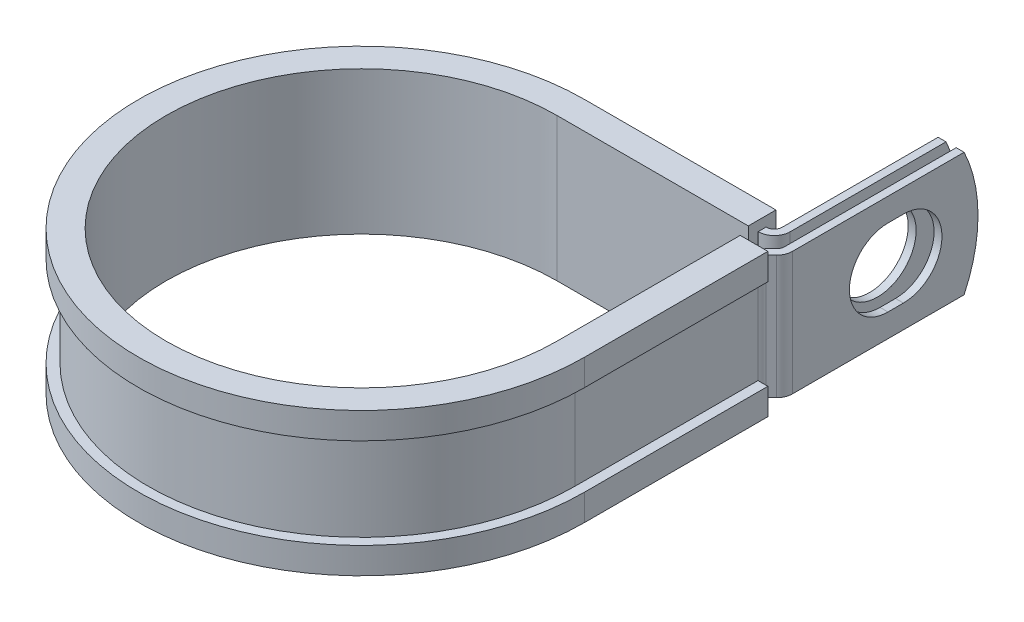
ISO-10303-21;
HEADER;
FILE_DESCRIPTION(('STEP AP214'),'2;1');
FILE_NAME('part.step','',(''),(''),'','','');
FILE_SCHEMA(('AUTOMOTIVE_DESIGN { 1 0 10303 214 1 1 1 1 }'));
ENDSEC;
DATA;
#1=APPLICATION_CONTEXT('core data for automotive mechanical design processes');
#2=APPLICATION_PROTOCOL_DEFINITION('international standard','automotive_design',2000,#1);
#3=PRODUCT_CONTEXT('',#1,'mechanical');
#4=PRODUCT('Part','Part','',(#3));
#5=PRODUCT_RELATED_PRODUCT_CATEGORY('part','',(#4));
#6=PRODUCT_DEFINITION_FORMATION('','',#4);
#7=PRODUCT_DEFINITION_CONTEXT('part definition',#1,'design');
#8=PRODUCT_DEFINITION('design','',#6,#7);
#9=PRODUCT_DEFINITION_SHAPE('','',#8);
#10=(LENGTH_UNIT() NAMED_UNIT(*) SI_UNIT(.MILLI.,.METRE.));
#11=(NAMED_UNIT(*) PLANE_ANGLE_UNIT() SI_UNIT($,.RADIAN.));
#12=(NAMED_UNIT(*) SI_UNIT($,.STERADIAN.) SOLID_ANGLE_UNIT());
#13=UNCERTAINTY_MEASURE_WITH_UNIT(LENGTH_MEASURE(1.E-05),#10,'distance_accuracy_value','');
#14=(GEOMETRIC_REPRESENTATION_CONTEXT(3) GLOBAL_UNCERTAINTY_ASSIGNED_CONTEXT((#13)) GLOBAL_UNIT_ASSIGNED_CONTEXT((#10,
#11,#12)) REPRESENTATION_CONTEXT('',''));
#15=CARTESIAN_POINT('',(0.,0.,0.));
#16=DIRECTION('',(0.,0.,1.));
#17=DIRECTION('',(1.,0.,0.));
#18=AXIS2_PLACEMENT_3D('',#15,#16,#17);
#19=CARTESIAN_POINT('',(32.3647698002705,-9.525,-31.6865));
#20=DIRECTION('',(0.,1.,0.));
#21=DIRECTION('',(1.,0.,0.));
#22=AXIS2_PLACEMENT_3D('',#19,#20,#21);
#23=PLANE('',#22);
#24=DIRECTION('',(0.,0.,-1.));
#25=VECTOR('',#24,1.);
#26=CARTESIAN_POINT('',(29.5199698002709,-9.525,-31.6865));
#27=LINE('',#26,#25);
#28=CARTESIAN_POINT('',(29.5199698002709,-9.525,-31.6865));
#29=VERTEX_POINT('',#28);
#30=CARTESIAN_POINT('',(29.5199698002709,-9.525,-32.9057));
#31=VERTEX_POINT('',#30);
#32=EDGE_CURVE('E523',#29,#31,#27,.T.);
#33=ORIENTED_EDGE('',*,*,#32,.T.);
#34=DIRECTION('',(1.,0.,0.));
#35=VECTOR('',#34,1.);
#36=CARTESIAN_POINT('',(0.,-9.525,-32.9057));
#37=LINE('',#36,#35);
#38=CARTESIAN_POINT('',(29.5707698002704,-9.525,-32.9057));
#39=VERTEX_POINT('',#38);
#40=EDGE_CURVE('E410',#39,#31,#37,.F.);
#41=ORIENTED_EDGE('',*,*,#40,.F.);
#42=CARTESIAN_POINT('',(29.5707698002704,-9.525,-34.1249));
#43=DIRECTION('',(0.,1.,0.));
#44=DIRECTION('',(1.,0.,0.));
#45=AXIS2_PLACEMENT_3D('',#42,#43,#44);
#46=CIRCLE('',#45,1.2192);
#47=CARTESIAN_POINT('',(30.7899698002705,-9.525,-34.1249));
#48=VERTEX_POINT('',#47);
#49=EDGE_CURVE('E408',#48,#39,#46,.F.);
#50=ORIENTED_EDGE('',*,*,#49,.F.);
#51=DIRECTION('',(0.,0.,1.));
#52=VECTOR('',#51,1.);
#53=CARTESIAN_POINT('',(30.7899698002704,-9.525,-60.325));
#54=LINE('',#53,#52);
#55=CARTESIAN_POINT('',(30.7899698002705,-9.525,-58.1804631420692));
#56=VERTEX_POINT('',#55);
#57=EDGE_CURVE('E406',#56,#48,#54,.T.);
#58=ORIENTED_EDGE('',*,*,#57,.F.);
#59=DIRECTION('',(-1.,0.,0.));
#60=VECTOR('',#59,1.);
#61=CARTESIAN_POINT('',(34.8031698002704,-9.525,-58.1804631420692));
#62=LINE('',#61,#60);
#63=CARTESIAN_POINT('',(32.0091698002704,-9.525,-58.1804631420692));
#64=VERTEX_POINT('',#63);
#65=EDGE_CURVE('E12',#64,#56,#62,.T.);
#66=ORIENTED_EDGE('',*,*,#65,.F.);
#67=DIRECTION('',(0.,0.,1.));
#68=VECTOR('',#67,1.);
#69=CARTESIAN_POINT('',(32.0091698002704,-9.525,-60.325));
#70=LINE('',#69,#68);
#71=CARTESIAN_POINT('',(32.0091698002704,-9.525,-34.1249));
#72=VERTEX_POINT('',#71);
#73=EDGE_CURVE('E404',#64,#72,#70,.T.);
#74=ORIENTED_EDGE('',*,*,#73,.T.);
#75=CARTESIAN_POINT('',(29.5707698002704,-9.525,-34.1249));
#76=DIRECTION('',(0.,-1.,0.));
#77=DIRECTION('',(0.,0.,1.));
#78=AXIS2_PLACEMENT_3D('',#75,#76,#77);
#79=CIRCLE('',#78,2.4384);
#80=CARTESIAN_POINT('',(29.5707698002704,-9.525,-31.6865));
#81=VERTEX_POINT('',#80);
#82=EDGE_CURVE('E401',#72,#81,#79,.T.);
#83=ORIENTED_EDGE('',*,*,#82,.T.);
#84=DIRECTION('',(-1.,0.,0.));
#85=VECTOR('',#84,1.);
#86=CARTESIAN_POINT('',(0.,-9.525,-31.6865));
#87=LINE('',#86,#85);
#88=EDGE_CURVE('E398',#81,#29,#87,.T.);
#89=ORIENTED_EDGE('',*,*,#88,.T.);
#90=EDGE_LOOP('',(#33,#41,#50,#58,#66,#74,#83,#89));
#91=FACE_BOUND('',#90,.T.);
#92=ADVANCED_FACE('F54',(#91),#23,.F.);
#93=CARTESIAN_POINT('',(32.3647698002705,9.525,-31.6865));
#94=DIRECTION('',(0.,1.,0.));
#95=DIRECTION('',(1.,0.,0.));
#96=AXIS2_PLACEMENT_3D('',#93,#94,#95);
#97=PLANE('',#96);
#98=DIRECTION('',(1.,0.,0.));
#99=VECTOR('',#98,1.);
#100=CARTESIAN_POINT('',(0.,9.525,-32.9057));
#101=LINE('',#100,#99);
#102=CARTESIAN_POINT('',(29.5707698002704,9.525,-32.9057));
#103=VERTEX_POINT('',#102);
#104=CARTESIAN_POINT('',(29.5199698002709,9.525,-32.9057));
#105=VERTEX_POINT('',#104);
#106=EDGE_CURVE('E368',#103,#105,#101,.F.);
#107=ORIENTED_EDGE('',*,*,#106,.T.);
#108=DIRECTION('',(0.,0.,1.));
#109=VECTOR('',#108,1.);
#110=CARTESIAN_POINT('',(29.5199698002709,9.525,-32.9057));
#111=LINE('',#110,#109);
#112=CARTESIAN_POINT('',(29.5199698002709,9.525,-31.6865));
#113=VERTEX_POINT('',#112);
#114=EDGE_CURVE('E517',#105,#113,#111,.T.);
#115=ORIENTED_EDGE('',*,*,#114,.T.);
#116=DIRECTION('',(-1.,0.,0.));
#117=VECTOR('',#116,1.);
#118=CARTESIAN_POINT('',(0.,9.525,-31.6865));
#119=LINE('',#118,#117);
#120=CARTESIAN_POINT('',(29.5707698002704,9.525,-31.6865));
#121=VERTEX_POINT('',#120);
#122=EDGE_CURVE('E625',#121,#113,#119,.T.);
#123=ORIENTED_EDGE('',*,*,#122,.F.);
#124=CARTESIAN_POINT('',(29.5707698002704,9.525,-34.1249));
#125=DIRECTION('',(0.,-1.,0.));
#126=DIRECTION('',(0.,0.,1.));
#127=AXIS2_PLACEMENT_3D('',#124,#125,#126);
#128=CIRCLE('',#127,2.4384);
#129=CARTESIAN_POINT('',(32.0091698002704,9.525,-34.1249));
#130=VERTEX_POINT('',#129);
#131=EDGE_CURVE('E370',#130,#121,#128,.T.);
#132=ORIENTED_EDGE('',*,*,#131,.F.);
#133=DIRECTION('',(0.,0.,1.));
#134=VECTOR('',#133,1.);
#135=CARTESIAN_POINT('',(32.0091698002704,9.525,-60.325));
#136=LINE('',#135,#134);
#137=CARTESIAN_POINT('',(32.0091698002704,9.525,-58.1804631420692));
#138=VERTEX_POINT('',#137);
#139=EDGE_CURVE('E361',#138,#130,#136,.T.);
#140=ORIENTED_EDGE('',*,*,#139,.F.);
#141=DIRECTION('',(-1.,0.,0.));
#142=VECTOR('',#141,1.);
#143=CARTESIAN_POINT('',(34.8031698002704,9.525,-58.1804631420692));
#144=LINE('',#143,#142);
#145=CARTESIAN_POINT('',(30.7899698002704,9.525,-58.1804631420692));
#146=VERTEX_POINT('',#145);
#147=EDGE_CURVE('E62',#138,#146,#144,.T.);
#148=ORIENTED_EDGE('',*,*,#147,.T.);
#149=DIRECTION('',(0.,0.,1.));
#150=VECTOR('',#149,1.);
#151=CARTESIAN_POINT('',(30.7899698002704,9.525,-60.325));
#152=LINE('',#151,#150);
#153=CARTESIAN_POINT('',(30.7899698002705,9.525,-34.1249));
#154=VERTEX_POINT('',#153);
#155=EDGE_CURVE('E358',#146,#154,#152,.T.);
#156=ORIENTED_EDGE('',*,*,#155,.T.);
#157=CARTESIAN_POINT('',(29.5707698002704,9.525,-34.1249));
#158=DIRECTION('',(0.,1.,0.));
#159=DIRECTION('',(1.,0.,0.));
#160=AXIS2_PLACEMENT_3D('',#157,#158,#159);
#161=CIRCLE('',#160,1.2192);
#162=EDGE_CURVE('E366',#154,#103,#161,.F.);
#163=ORIENTED_EDGE('',*,*,#162,.T.);
#164=EDGE_LOOP('',(#107,#115,#123,#132,#140,#148,#156,#163));
#165=FACE_BOUND('',#164,.T.);
#166=ADVANCED_FACE('F357',(#165),#97,.T.);
#167=CARTESIAN_POINT('',(0.,9.525,-31.6865));
#168=DIRECTION('',(0.,0.,1.));
#169=DIRECTION('',(1.,0.,0.));
#170=AXIS2_PLACEMENT_3D('',#167,#168,#169);
#171=PLANE('',#170);
#172=ORIENTED_EDGE('',*,*,#122,.T.);
#173=DIRECTION('',(0.,-1.,0.));
#174=VECTOR('',#173,1.);
#175=CARTESIAN_POINT('',(29.5199698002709,9.525,-31.6865));
#176=LINE('',#175,#174);
#177=EDGE_CURVE('E520',#113,#29,#176,.T.);
#178=ORIENTED_EDGE('',*,*,#177,.T.);
#179=ORIENTED_EDGE('',*,*,#88,.F.);
#180=DIRECTION('',(0.,-1.,0.));
#181=VECTOR('',#180,1.);
#182=CARTESIAN_POINT('',(29.5707698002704,9.525,-31.6865));
#183=LINE('',#182,#181);
#184=EDGE_CURVE('E344',#121,#81,#183,.T.);
#185=ORIENTED_EDGE('',*,*,#184,.F.);
#186=EDGE_LOOP('',(#172,#178,#179,#185));
#187=FACE_BOUND('',#186,.T.);
#188=ADVANCED_FACE('F635',(#187),#171,.T.);
#189=CARTESIAN_POINT('',(34.8031698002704,9.525,-31.6865));
#190=DIRECTION('',(-1.,0.,0.));
#191=DIRECTION('',(0.,0.,1.));
#192=AXIS2_PLACEMENT_3D('',#189,#190,#191);
#193=PLANE('',#192);
#194=CARTESIAN_POINT('',(34.8031698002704,0.,-48.8187999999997));
#195=DIRECTION('',(1.,0.,0.));
#196=DIRECTION('',(0.,0.,-1.));
#197=AXIS2_PLACEMENT_3D('',#194,#195,#196);
#198=CIRCLE('',#197,5.9436);
#199=CARTESIAN_POINT('',(34.8031698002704,-5.9436,-48.8188000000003));
#200=VERTEX_POINT('',#199);
#201=CARTESIAN_POINT('',(34.8031698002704,5.9436,-48.8188000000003));
#202=VERTEX_POINT('',#201);
#203=EDGE_CURVE('E580',#200,#202,#198,.T.);
#204=ORIENTED_EDGE('',*,*,#203,.F.);
#205=DIRECTION('',(0.,0.,-1.));
#206=VECTOR('',#205,1.);
#207=CARTESIAN_POINT('',(34.8031698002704,-5.9436,-46.4311999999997));
#208=LINE('',#207,#206);
#209=CARTESIAN_POINT('',(34.8031698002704,-5.9436,-46.4311999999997));
#210=VERTEX_POINT('',#209);
#211=EDGE_CURVE('E583',#210,#200,#208,.T.);
#212=ORIENTED_EDGE('',*,*,#211,.F.);
#213=CARTESIAN_POINT('',(34.8031698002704,0.,-46.4311999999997));
#214=DIRECTION('',(1.,0.,0.));
#215=DIRECTION('',(0.,0.,-1.));
#216=AXIS2_PLACEMENT_3D('',#213,#214,#215);
#217=CIRCLE('',#216,5.9436);
#218=CARTESIAN_POINT('',(34.8031698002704,5.9436,-46.4311999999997));
#219=VERTEX_POINT('',#218);
#220=EDGE_CURVE('E576',#219,#210,#217,.T.);
#221=ORIENTED_EDGE('',*,*,#220,.F.);
#222=DIRECTION('',(0.,0.,1.));
#223=VECTOR('',#222,1.);
#224=CARTESIAN_POINT('',(34.8031698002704,5.9436,-46.4311999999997));
#225=LINE('',#224,#223);
#226=EDGE_CURVE('E577',#202,#219,#225,.T.);
#227=ORIENTED_EDGE('',*,*,#226,.F.);
#228=EDGE_LOOP('',(#204,#212,#221,#227));
#229=FACE_BOUND('',#228,.T.);
#230=DIRECTION('',(0.,0.,-1.));
#231=VECTOR('',#230,1.);
#232=CARTESIAN_POINT('',(34.8031698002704,-9.525,-31.6865));
#233=LINE('',#232,#231);
#234=CARTESIAN_POINT('',(34.8031698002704,-9.525,-31.6865));
#235=VERTEX_POINT('',#234);
#236=CARTESIAN_POINT('',(34.8031698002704,-9.525,-58.1804631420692));
#237=VERTEX_POINT('',#236);
#238=EDGE_CURVE('E382',#235,#237,#233,.T.);
#239=ORIENTED_EDGE('',*,*,#238,.T.);
#240=CARTESIAN_POINT('',(34.8031698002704,0.,-38.1));
#241=DIRECTION('',(-1.,0.,0.));
#242=DIRECTION('',(0.,0.,1.));
#243=AXIS2_PLACEMENT_3D('',#240,#241,#242);
#244=CIRCLE('',#243,22.225);
#245=CARTESIAN_POINT('',(34.8031698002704,9.525,-58.1804631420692));
#246=VERTEX_POINT('',#245);
#247=EDGE_CURVE('E568',#246,#237,#244,.T.);
#248=ORIENTED_EDGE('',*,*,#247,.F.);
#249=DIRECTION('',(0.,0.,-1.));
#250=VECTOR('',#249,1.);
#251=CARTESIAN_POINT('',(34.8031698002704,9.525,-31.6865));
#252=LINE('',#251,#250);
#253=CARTESIAN_POINT('',(34.8031698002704,9.525,-31.6865));
#254=VERTEX_POINT('',#253);
#255=EDGE_CURVE('E419',#254,#246,#252,.T.);
#256=ORIENTED_EDGE('',*,*,#255,.F.);
#257=DIRECTION('',(0.,-1.,0.));
#258=VECTOR('',#257,1.);
#259=CARTESIAN_POINT('',(34.8031698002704,9.525,-31.6865));
#260=LINE('',#259,#258);
#261=EDGE_CURVE('E381',#254,#235,#260,.T.);
#262=ORIENTED_EDGE('',*,*,#261,.T.);
#263=EDGE_LOOP('',(#239,#248,#256,#262));
#264=FACE_BOUND('',#263,.T.);
#265=ADVANCED_FACE('F56',(#229,#264),#193,.F.);
#266=CARTESIAN_POINT('',(33.5839698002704,9.525,-31.6865));
#267=DIRECTION('',(-1.,0.,0.));
#268=DIRECTION('',(0.,0.,1.));
#269=AXIS2_PLACEMENT_3D('',#266,#267,#268);
#270=PLANE('',#269);
#271=DIRECTION('',(0.,0.,-1.));
#272=VECTOR('',#271,1.);
#273=CARTESIAN_POINT('',(33.5839698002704,-5.9436,-46.4311999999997));
#274=LINE('',#273,#272);
#275=CARTESIAN_POINT('',(33.5839698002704,-5.9436,-46.4311999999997));
#276=VERTEX_POINT('',#275);
#277=CARTESIAN_POINT('',(33.5839698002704,-5.9436,-48.8188000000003));
#278=VERTEX_POINT('',#277);
#279=EDGE_CURVE('E579',#276,#278,#274,.T.);
#280=ORIENTED_EDGE('',*,*,#279,.T.);
#281=CARTESIAN_POINT('',(33.5839698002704,0.,-48.8187999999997));
#282=DIRECTION('',(-1.,0.,0.));
#283=DIRECTION('',(0.,0.,1.));
#284=AXIS2_PLACEMENT_3D('',#281,#282,#283);
#285=CIRCLE('',#284,5.9436);
#286=CARTESIAN_POINT('',(33.5839698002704,5.9436,-48.8188000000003));
#287=VERTEX_POINT('',#286);
#288=EDGE_CURVE('E600',#278,#287,#285,.F.);
#289=ORIENTED_EDGE('',*,*,#288,.T.);
#290=DIRECTION('',(0.,0.,1.));
#291=VECTOR('',#290,1.);
#292=CARTESIAN_POINT('',(33.5839698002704,5.9436,-46.4311999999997));
#293=LINE('',#292,#291);
#294=CARTESIAN_POINT('',(33.5839698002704,5.9436,-46.4311999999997));
#295=VERTEX_POINT('',#294);
#296=EDGE_CURVE('E596',#287,#295,#293,.T.);
#297=ORIENTED_EDGE('',*,*,#296,.T.);
#298=CARTESIAN_POINT('',(33.5839698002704,0.,-46.4311999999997));
#299=DIRECTION('',(-1.,0.,0.));
#300=DIRECTION('',(0.,0.,1.));
#301=AXIS2_PLACEMENT_3D('',#298,#299,#300);
#302=CIRCLE('',#301,5.9436);
#303=EDGE_CURVE('E591',#295,#276,#302,.F.);
#304=ORIENTED_EDGE('',*,*,#303,.T.);
#305=EDGE_LOOP('',(#280,#289,#297,#304));
#306=FACE_BOUND('',#305,.T.);
#307=CARTESIAN_POINT('',(33.5839698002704,0.,-38.1));
#308=DIRECTION('',(-1.,0.,0.));
#309=DIRECTION('',(0.,0.,1.));
#310=AXIS2_PLACEMENT_3D('',#307,#308,#309);
#311=CIRCLE('',#310,22.225);
#312=CARTESIAN_POINT('',(33.5839698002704,9.525,-58.1804631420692));
#313=VERTEX_POINT('',#312);
#314=CARTESIAN_POINT('',(33.5839698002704,-9.525,-58.1804631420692));
#315=VERTEX_POINT('',#314);
#316=EDGE_CURVE('E76',#313,#315,#311,.T.);
#317=ORIENTED_EDGE('',*,*,#316,.T.);
#318=DIRECTION('',(0.,0.,-1.));
#319=VECTOR('',#318,1.);
#320=CARTESIAN_POINT('',(33.5839698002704,-9.525,-31.6865));
#321=LINE('',#320,#319);
#322=CARTESIAN_POINT('',(33.5839698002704,-9.525,-31.6865));
#323=VERTEX_POINT('',#322);
#324=EDGE_CURVE('E385',#323,#315,#321,.T.);
#325=ORIENTED_EDGE('',*,*,#324,.F.);
#326=DIRECTION('',(0.,-1.,0.));
#327=VECTOR('',#326,1.);
#328=CARTESIAN_POINT('',(33.5839698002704,9.525,-31.6865));
#329=LINE('',#328,#327);
#330=CARTESIAN_POINT('',(33.5839698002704,9.525,-31.6865));
#331=VERTEX_POINT('',#330);
#332=EDGE_CURVE('E352',#331,#323,#329,.T.);
#333=ORIENTED_EDGE('',*,*,#332,.F.);
#334=DIRECTION('',(0.,0.,-1.));
#335=VECTOR('',#334,1.);
#336=CARTESIAN_POINT('',(33.5839698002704,9.525,-31.6865));
#337=LINE('',#336,#335);
#338=EDGE_CURVE('E615',#331,#313,#337,.T.);
#339=ORIENTED_EDGE('',*,*,#338,.T.);
#340=EDGE_LOOP('',(#317,#325,#333,#339));
#341=FACE_BOUND('',#340,.T.);
#342=ADVANCED_FACE('F689',(#306,#341),#270,.T.);
#343=CARTESIAN_POINT('',(32.0091698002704,9.525,-60.325));
#344=DIRECTION('',(1.,0.,0.));
#345=DIRECTION('',(0.,0.,-1.));
#346=AXIS2_PLACEMENT_3D('',#343,#344,#345);
#347=PLANE('',#346);
#348=CARTESIAN_POINT('',(32.0091698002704,0.,-47.625));
#349=DIRECTION('',(1.,0.,0.));
#350=DIRECTION('',(0.,0.,-1.));
#351=AXIS2_PLACEMENT_3D('',#348,#349,#350);
#352=CIRCLE('',#351,5.9436);
#353=CARTESIAN_POINT('',(32.0091698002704,0.,-53.5686));
#354=VERTEX_POINT('',#353);
#355=EDGE_CURVE('E386',#354,#354,#352,.F.);
#356=ORIENTED_EDGE('',*,*,#355,.T.);
#357=EDGE_LOOP('',(#356));
#358=FACE_BOUND('',#357,.T.);
#359=ORIENTED_EDGE('',*,*,#73,.F.);
#360=CARTESIAN_POINT('',(32.0091698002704,0.,-38.1));
#361=DIRECTION('',(1.,0.,0.));
#362=DIRECTION('',(0.,0.,-1.));
#363=AXIS2_PLACEMENT_3D('',#360,#361,#362);
#364=CIRCLE('',#363,22.225);
#365=EDGE_CURVE('E573',#64,#138,#364,.T.);
#366=ORIENTED_EDGE('',*,*,#365,.T.);
#367=ORIENTED_EDGE('',*,*,#139,.T.);
#368=DIRECTION('',(0.,-1.,0.));
#369=VECTOR('',#368,1.);
#370=CARTESIAN_POINT('',(32.0091698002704,9.525,-34.1249));
#371=LINE('',#370,#369);
#372=EDGE_CURVE('E341',#130,#72,#371,.T.);
#373=ORIENTED_EDGE('',*,*,#372,.T.);
#374=EDGE_LOOP('',(#359,#366,#367,#373));
#375=FACE_BOUND('',#374,.T.);
#376=ADVANCED_FACE('F641',(#358,#375),#347,.T.);
#377=CARTESIAN_POINT('',(30.7899698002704,9.525,-60.325));
#378=DIRECTION('',(1.,0.,0.));
#379=DIRECTION('',(0.,0.,-1.));
#380=AXIS2_PLACEMENT_3D('',#377,#378,#379);
#381=PLANE('',#380);
#382=CARTESIAN_POINT('',(30.7899698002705,0.,-47.625));
#383=DIRECTION('',(-1.,0.,0.));
#384=DIRECTION('',(0.,0.,1.));
#385=AXIS2_PLACEMENT_3D('',#382,#383,#384);
#386=CIRCLE('',#385,5.9436);
#387=CARTESIAN_POINT('',(30.7899698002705,0.,-41.6814));
#388=VERTEX_POINT('',#387);
#389=EDGE_CURVE('E608',#388,#388,#386,.T.);
#390=ORIENTED_EDGE('',*,*,#389,.F.);
#391=EDGE_LOOP('',(#390));
#392=FACE_BOUND('',#391,.T.);
#393=CARTESIAN_POINT('',(30.7899698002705,0.,-38.1));
#394=DIRECTION('',(-1.,0.,0.));
#395=DIRECTION('',(0.,0.,1.));
#396=AXIS2_PLACEMENT_3D('',#393,#394,#395);
#397=CIRCLE('',#396,22.225);
#398=EDGE_CURVE('E68',#146,#56,#397,.T.);
#399=ORIENTED_EDGE('',*,*,#398,.T.);
#400=ORIENTED_EDGE('',*,*,#57,.T.);
#401=DIRECTION('',(0.,-1.,0.));
#402=VECTOR('',#401,1.);
#403=CARTESIAN_POINT('',(30.7899698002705,9.525,-34.1249));
#404=LINE('',#403,#402);
#405=EDGE_CURVE('E338',#154,#48,#404,.T.);
#406=ORIENTED_EDGE('',*,*,#405,.F.);
#407=ORIENTED_EDGE('',*,*,#155,.F.);
#408=EDGE_LOOP('',(#399,#400,#406,#407));
#409=FACE_BOUND('',#408,.T.);
#410=ADVANCED_FACE('F364',(#392,#409),#381,.F.);
#411=CARTESIAN_POINT('',(34.1249,-9.525,-28.2740026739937));
#412=DIRECTION('',(0.,1.,0.));
#413=DIRECTION('',(1.,0.,0.));
#414=AXIS2_PLACEMENT_3D('',#411,#412,#413);
#415=CIRCLE('',#414,1.2192);
#416=CARTESIAN_POINT('',(32.9057,-9.525,-28.2740026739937));
#417=VERTEX_POINT('',#416);
#418=CARTESIAN_POINT('',(33.2627954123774,-9.525,-29.1361072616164));
#419=VERTEX_POINT('',#418);
#420=EDGE_CURVE('E413',#417,#419,#415,.F.);
#421=ORIENTED_EDGE('',*,*,#420,.F.);
#422=DIRECTION('',(1.,0.,0.));
#423=VECTOR('',#422,1.);
#424=CARTESIAN_POINT('',(31.6865,-9.525,-28.2740026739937));
#425=LINE('',#424,#423);
#426=CARTESIAN_POINT('',(31.6865,-9.525,-28.2740026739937));
#427=VERTEX_POINT('',#426);
#428=EDGE_CURVE('E451',#427,#417,#425,.T.);
#429=ORIENTED_EDGE('',*,*,#428,.F.);
#430=CARTESIAN_POINT('',(34.1249,-9.525,-28.2740026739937));
#431=DIRECTION('',(0.,-1.,0.));
#432=DIRECTION('',(0.,0.,1.));
#433=AXIS2_PLACEMENT_3D('',#430,#431,#432);
#434=CIRCLE('',#433,2.4384);
#435=CARTESIAN_POINT('',(32.4006908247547,-9.525,-29.998211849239));
#436=VERTEX_POINT('',#435);
#437=EDGE_CURVE('E395',#427,#436,#434,.T.);
#438=ORIENTED_EDGE('',*,*,#437,.T.);
#439=DIRECTION('',(0.707106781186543,0.,-0.707106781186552));
#440=VECTOR('',#439,1.);
#441=CARTESIAN_POINT('',(32.4006908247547,-9.525,-29.998211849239));
#442=LINE('',#441,#440);
#443=CARTESIAN_POINT('',(33.2268743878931,-9.525,-30.8243954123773));
#444=VERTEX_POINT('',#443);
#445=EDGE_CURVE('E392',#436,#444,#442,.T.);
#446=ORIENTED_EDGE('',*,*,#445,.T.);
#447=CARTESIAN_POINT('',(32.3647698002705,-9.525,-31.6865));
#448=DIRECTION('',(0.,1.,0.));
#449=DIRECTION('',(0.,0.,1.));
#450=AXIS2_PLACEMENT_3D('',#447,#448,#449);
#451=CIRCLE('',#450,1.21919999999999);
#452=EDGE_CURVE('E389',#444,#323,#451,.T.);
#453=ORIENTED_EDGE('',*,*,#452,.T.);
#454=ORIENTED_EDGE('',*,*,#324,.T.);
#455=DIRECTION('',(-1.,0.,0.));
#456=VECTOR('',#455,1.);
#457=CARTESIAN_POINT('',(34.8031698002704,-9.525,-58.1804631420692));
#458=LINE('',#457,#456);
#459=EDGE_CURVE('E566',#237,#315,#458,.T.);
#460=ORIENTED_EDGE('',*,*,#459,.F.);
#461=ORIENTED_EDGE('',*,*,#238,.F.);
#462=CARTESIAN_POINT('',(32.3647698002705,-9.525,-31.6865));
#463=DIRECTION('',(0.,1.,0.));
#464=DIRECTION('',(1.,0.,0.));
#465=AXIS2_PLACEMENT_3D('',#462,#463,#464);
#466=CIRCLE('',#465,2.43839999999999);
#467=CARTESIAN_POINT('',(34.0889789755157,-9.525,-29.9622908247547));
#468=VERTEX_POINT('',#467);
#469=EDGE_CURVE('E417',#468,#235,#466,.T.);
#470=ORIENTED_EDGE('',*,*,#469,.F.);
#471=DIRECTION('',(0.707106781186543,0.,-0.707106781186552));
#472=VECTOR('',#471,1.);
#473=CARTESIAN_POINT('',(33.2627954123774,-9.525,-29.1361072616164));
#474=LINE('',#473,#472);
#475=EDGE_CURVE('E415',#419,#468,#474,.T.);
#476=ORIENTED_EDGE('',*,*,#475,.F.);
#477=EDGE_LOOP('',(#421,#429,#438,#446,#453,#454,#460,#461,#470,#476));
#478=FACE_BOUND('',#477,.T.);
#479=ADVANCED_FACE('F675',(#478),#23,.F.);
#480=DIRECTION('',(-1.,0.,0.));
#481=VECTOR('',#480,1.);
#482=CARTESIAN_POINT('',(32.9057,9.525,-28.2740026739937));
#483=LINE('',#482,#481);
#484=CARTESIAN_POINT('',(32.9057,9.525,-28.2740026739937));
#485=VERTEX_POINT('',#484);
#486=CARTESIAN_POINT('',(31.6865,9.525,-28.2740026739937));
#487=VERTEX_POINT('',#486);
#488=EDGE_CURVE('E440',#485,#487,#483,.T.);
#489=ORIENTED_EDGE('',*,*,#488,.F.);
#490=CARTESIAN_POINT('',(34.1249,9.525,-28.2740026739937));
#491=DIRECTION('',(0.,1.,0.));
#492=DIRECTION('',(1.,0.,0.));
#493=AXIS2_PLACEMENT_3D('',#490,#491,#492);
#494=CIRCLE('',#493,1.2192);
#495=CARTESIAN_POINT('',(33.2627954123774,9.525,-29.1361072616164));
#496=VERTEX_POINT('',#495);
#497=EDGE_CURVE('E375',#485,#496,#494,.F.);
#498=ORIENTED_EDGE('',*,*,#497,.T.);
#499=DIRECTION('',(0.707106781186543,0.,-0.707106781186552));
#500=VECTOR('',#499,1.);
#501=CARTESIAN_POINT('',(33.2627954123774,9.525,-29.1361072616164));
#502=LINE('',#501,#500);
#503=CARTESIAN_POINT('',(34.0889789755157,9.525,-29.9622908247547));
#504=VERTEX_POINT('',#503);
#505=EDGE_CURVE('E377',#496,#504,#502,.T.);
#506=ORIENTED_EDGE('',*,*,#505,.T.);
#507=CARTESIAN_POINT('',(32.3647698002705,9.525,-31.6865));
#508=DIRECTION('',(0.,1.,0.));
#509=DIRECTION('',(1.,0.,0.));
#510=AXIS2_PLACEMENT_3D('',#507,#508,#509);
#511=CIRCLE('',#510,2.43839999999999);
#512=EDGE_CURVE('E379',#504,#254,#511,.T.);
#513=ORIENTED_EDGE('',*,*,#512,.T.);
#514=ORIENTED_EDGE('',*,*,#255,.T.);
#515=DIRECTION('',(-1.,0.,0.));
#516=VECTOR('',#515,1.);
#517=CARTESIAN_POINT('',(34.8031698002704,9.525,-58.1804631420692));
#518=LINE('',#517,#516);
#519=EDGE_CURVE('E570',#246,#313,#518,.T.);
#520=ORIENTED_EDGE('',*,*,#519,.T.);
#521=ORIENTED_EDGE('',*,*,#338,.F.);
#522=CARTESIAN_POINT('',(32.3647698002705,9.525,-31.6865));
#523=DIRECTION('',(0.,1.,0.));
#524=DIRECTION('',(0.,0.,1.));
#525=AXIS2_PLACEMENT_3D('',#522,#523,#524);
#526=CIRCLE('',#525,1.21919999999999);
#527=CARTESIAN_POINT('',(33.2268743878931,9.525,-30.8243954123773));
#528=VERTEX_POINT('',#527);
#529=EDGE_CURVE('E618',#528,#331,#526,.T.);
#530=ORIENTED_EDGE('',*,*,#529,.F.);
#531=DIRECTION('',(0.707106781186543,0.,-0.707106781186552));
#532=VECTOR('',#531,1.);
#533=CARTESIAN_POINT('',(32.4006908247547,9.525,-29.998211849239));
#534=LINE('',#533,#532);
#535=CARTESIAN_POINT('',(32.4006908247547,9.525,-29.998211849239));
#536=VERTEX_POINT('',#535);
#537=EDGE_CURVE('E621',#536,#528,#534,.T.);
#538=ORIENTED_EDGE('',*,*,#537,.F.);
#539=CARTESIAN_POINT('',(34.1249,9.525,-28.2740026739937));
#540=DIRECTION('',(0.,-1.,0.));
#541=DIRECTION('',(0.,0.,1.));
#542=AXIS2_PLACEMENT_3D('',#539,#540,#541);
#543=CIRCLE('',#542,2.4384);
#544=EDGE_CURVE('E450',#487,#536,#543,.T.);
#545=ORIENTED_EDGE('',*,*,#544,.F.);
#546=EDGE_LOOP('',(#489,#498,#506,#513,#514,#520,#521,#530,#538,#545));
#547=FACE_BOUND('',#546,.T.);
#548=ADVANCED_FACE('F447',(#547),#97,.T.);
#549=CARTESIAN_POINT('',(32.3647698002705,9.525,-31.6865));
#550=DIRECTION('',(0.,-1.,0.));
#551=DIRECTION('',(0.,0.,-1.));
#552=AXIS2_PLACEMENT_3D('',#549,#550,#551);
#553=CYLINDRICAL_SURFACE('',#552,1.21919999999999);
#554=ORIENTED_EDGE('',*,*,#452,.F.);
#555=DIRECTION('',(0.,-1.,0.));
#556=VECTOR('',#555,1.);
#557=CARTESIAN_POINT('',(33.2268743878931,9.525,-30.8243954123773));
#558=LINE('',#557,#556);
#559=EDGE_CURVE('E350',#528,#444,#558,.T.);
#560=ORIENTED_EDGE('',*,*,#559,.F.);
#561=ORIENTED_EDGE('',*,*,#529,.T.);
#562=ORIENTED_EDGE('',*,*,#332,.T.);
#563=EDGE_LOOP('',(#554,#560,#561,#562));
#564=FACE_BOUND('',#563,.T.);
#565=ADVANCED_FACE('F685',(#564),#553,.F.);
#566=CARTESIAN_POINT('',(32.4006908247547,9.525,-29.998211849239));
#567=DIRECTION('',(-0.707106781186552,0.,-0.707106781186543));
#568=DIRECTION('',(-0.707106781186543,0.,0.707106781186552));
#569=AXIS2_PLACEMENT_3D('',#566,#567,#568);
#570=PLANE('',#569);
#571=ORIENTED_EDGE('',*,*,#445,.F.);
#572=DIRECTION('',(0.,-1.,0.));
#573=VECTOR('',#572,1.);
#574=CARTESIAN_POINT('',(32.4006908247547,9.525,-29.998211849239));
#575=LINE('',#574,#573);
#576=EDGE_CURVE('E348',#536,#436,#575,.T.);
#577=ORIENTED_EDGE('',*,*,#576,.F.);
#578=ORIENTED_EDGE('',*,*,#537,.T.);
#579=ORIENTED_EDGE('',*,*,#559,.T.);
#580=EDGE_LOOP('',(#571,#577,#578,#579));
#581=FACE_BOUND('',#580,.T.);
#582=ADVANCED_FACE('F680',(#581),#570,.T.);
#583=CARTESIAN_POINT('',(34.1249,9.525,-28.2740026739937));
#584=DIRECTION('',(0.,-1.,0.));
#585=DIRECTION('',(0.,0.,-1.));
#586=AXIS2_PLACEMENT_3D('',#583,#584,#585);
#587=CYLINDRICAL_SURFACE('',#586,2.4384);
#588=ORIENTED_EDGE('',*,*,#437,.F.);
#589=DIRECTION('',(0.,-1.,0.));
#590=VECTOR('',#589,1.);
#591=CARTESIAN_POINT('',(31.6865,9.525,-28.2740026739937));
#592=LINE('',#591,#590);
#593=EDGE_CURVE('E346',#487,#427,#592,.T.);
#594=ORIENTED_EDGE('',*,*,#593,.F.);
#595=ORIENTED_EDGE('',*,*,#544,.T.);
#596=ORIENTED_EDGE('',*,*,#576,.T.);
#597=EDGE_LOOP('',(#588,#594,#595,#596));
#598=FACE_BOUND('',#597,.T.);
#599=ADVANCED_FACE('F677',(#598),#587,.T.);
#600=CARTESIAN_POINT('',(29.5707698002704,9.525,-34.1249));
#601=DIRECTION('',(0.,-1.,0.));
#602=DIRECTION('',(0.,0.,-1.));
#603=AXIS2_PLACEMENT_3D('',#600,#601,#602);
#604=CYLINDRICAL_SURFACE('',#603,2.4384);
#605=ORIENTED_EDGE('',*,*,#82,.F.);
#606=ORIENTED_EDGE('',*,*,#372,.F.);
#607=ORIENTED_EDGE('',*,*,#131,.T.);
#608=ORIENTED_EDGE('',*,*,#184,.T.);
#609=EDGE_LOOP('',(#605,#606,#607,#608));
#610=FACE_BOUND('',#609,.T.);
#611=ADVANCED_FACE('F631',(#610),#604,.T.);
#612=CARTESIAN_POINT('',(29.5707698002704,9.525,-34.1249));
#613=DIRECTION('',(0.,-1.,0.));
#614=DIRECTION('',(0.,0.,-1.));
#615=AXIS2_PLACEMENT_3D('',#612,#613,#614);
#616=CYLINDRICAL_SURFACE('',#615,1.2192);
#617=ORIENTED_EDGE('',*,*,#49,.T.);
#618=DIRECTION('',(0.,-1.,0.));
#619=VECTOR('',#618,1.);
#620=CARTESIAN_POINT('',(29.5707698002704,9.525,-32.9057));
#621=LINE('',#620,#619);
#622=EDGE_CURVE('E329',#103,#39,#621,.T.);
#623=ORIENTED_EDGE('',*,*,#622,.F.);
#624=ORIENTED_EDGE('',*,*,#162,.F.);
#625=ORIENTED_EDGE('',*,*,#405,.T.);
#626=EDGE_LOOP('',(#617,#623,#624,#625));
#627=FACE_BOUND('',#626,.T.);
#628=ADVANCED_FACE('F646',(#627),#616,.F.);
#629=CARTESIAN_POINT('',(0.,9.525,-32.9057));
#630=DIRECTION('',(0.,0.,1.));
#631=DIRECTION('',(1.,0.,0.));
#632=AXIS2_PLACEMENT_3D('',#629,#630,#631);
#633=PLANE('',#632);
#634=DIRECTION('',(0.,-1.,0.));
#635=VECTOR('',#634,1.);
#636=CARTESIAN_POINT('',(0.,9.525,-32.9057));
#637=LINE('',#636,#635);
#638=CARTESIAN_POINT('',(4.61573442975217E-13,6.985,-32.9057));
#639=VERTEX_POINT('',#638);
#640=CARTESIAN_POINT('',(4.61573442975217E-13,-6.985,-32.9057));
#641=VERTEX_POINT('',#640);
#642=EDGE_CURVE('E320',#639,#641,#637,.T.);
#643=ORIENTED_EDGE('',*,*,#642,.F.);
#644=DIRECTION('',(1.,0.,0.));
#645=VECTOR('',#644,1.);
#646=CARTESIAN_POINT('',(4.61573442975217E-13,6.985,-32.9057));
#647=LINE('',#646,#645);
#648=CARTESIAN_POINT('',(29.5199698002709,6.985,-32.9057));
#649=VERTEX_POINT('',#648);
#650=EDGE_CURVE('E563',#639,#649,#647,.T.);
#651=ORIENTED_EDGE('',*,*,#650,.T.);
#652=DIRECTION('',(0.,1.,0.));
#653=VECTOR('',#652,1.);
#654=CARTESIAN_POINT('',(29.5199698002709,9.525,-32.9057));
#655=LINE('',#654,#653);
#656=EDGE_CURVE('E514',#649,#105,#655,.T.);
#657=ORIENTED_EDGE('',*,*,#656,.T.);
#658=ORIENTED_EDGE('',*,*,#106,.F.);
#659=ORIENTED_EDGE('',*,*,#622,.T.);
#660=ORIENTED_EDGE('',*,*,#40,.T.);
#661=DIRECTION('',(0.,1.,0.));
#662=VECTOR('',#661,1.);
#663=CARTESIAN_POINT('',(29.5199698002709,-9.525,-32.9057));
#664=LINE('',#663,#662);
#665=CARTESIAN_POINT('',(29.5199698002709,-6.985,-32.9057));
#666=VERTEX_POINT('',#665);
#667=EDGE_CURVE('E526',#31,#666,#664,.T.);
#668=ORIENTED_EDGE('',*,*,#667,.T.);
#669=DIRECTION('',(1.,0.,0.));
#670=VECTOR('',#669,1.);
#671=CARTESIAN_POINT('',(4.61573442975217E-13,-6.985,-32.9057));
#672=LINE('',#671,#670);
#673=EDGE_CURVE('E543',#641,#666,#672,.T.);
#674=ORIENTED_EDGE('',*,*,#673,.F.);
#675=EDGE_LOOP('',(#643,#651,#657,#658,#659,#660,#668,#674));
#676=FACE_BOUND('',#675,.T.);
#677=ADVANCED_FACE('F650',(#676),#633,.F.);
#678=CARTESIAN_POINT('',(0.,9.525,0.));
#679=DIRECTION('',(0.,-1.,0.));
#680=DIRECTION('',(0.,0.,-1.));
#681=AXIS2_PLACEMENT_3D('',#678,#679,#680);
#682=CYLINDRICAL_SURFACE('',#681,32.9057);
#683=DIRECTION('',(0.,-1.,0.));
#684=VECTOR('',#683,1.);
#685=CARTESIAN_POINT('',(32.9057,9.525,0.));
#686=LINE('',#685,#684);
#687=CARTESIAN_POINT('',(32.9057,6.985,0.));
#688=VERTEX_POINT('',#687);
#689=CARTESIAN_POINT('',(32.9057,-6.985,0.));
#690=VERTEX_POINT('',#689);
#691=EDGE_CURVE('E318',#688,#690,#686,.T.);
#692=ORIENTED_EDGE('',*,*,#691,.F.);
#693=CARTESIAN_POINT('',(0.,6.985,0.));
#694=DIRECTION('',(0.,-1.,0.));
#695=DIRECTION('',(0.,0.,-1.));
#696=AXIS2_PLACEMENT_3D('',#693,#694,#695);
#697=CIRCLE('',#696,32.9057);
#698=EDGE_CURVE('E512',#688,#639,#697,.T.);
#699=ORIENTED_EDGE('',*,*,#698,.T.);
#700=ORIENTED_EDGE('',*,*,#642,.T.);
#701=CARTESIAN_POINT('',(0.,-6.985,0.));
#702=DIRECTION('',(0.,-1.,0.));
#703=DIRECTION('',(0.,0.,-1.));
#704=AXIS2_PLACEMENT_3D('',#701,#702,#703);
#705=CIRCLE('',#704,32.9057);
#706=EDGE_CURVE('E301',#690,#641,#705,.T.);
#707=ORIENTED_EDGE('',*,*,#706,.F.);
#708=EDGE_LOOP('',(#692,#699,#700,#707));
#709=FACE_BOUND('',#708,.T.);
#710=ADVANCED_FACE('F316',(#709),#682,.T.);
#711=CARTESIAN_POINT('',(32.9057,9.525,0.));
#712=DIRECTION('',(-1.,0.,0.));
#713=DIRECTION('',(0.,0.,1.));
#714=AXIS2_PLACEMENT_3D('',#711,#712,#713);
#715=PLANE('',#714);
#716=DIRECTION('',(0.,-1.,0.));
#717=VECTOR('',#716,1.);
#718=CARTESIAN_POINT('',(32.9057,9.525,-28.2740026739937));
#719=LINE('',#718,#717);
#720=CARTESIAN_POINT('',(32.9057,6.985,-28.2740026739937));
#721=VERTEX_POINT('',#720);
#722=CARTESIAN_POINT('',(32.9057,-6.985,-28.2740026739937));
#723=VERTEX_POINT('',#722);
#724=EDGE_CURVE('E332',#721,#723,#719,.T.);
#725=ORIENTED_EDGE('',*,*,#724,.F.);
#726=DIRECTION('',(0.,0.,-1.));
#727=VECTOR('',#726,1.);
#728=CARTESIAN_POINT('',(32.9057,6.985,0.));
#729=LINE('',#728,#727);
#730=EDGE_CURVE('E326',#688,#721,#729,.T.);
#731=ORIENTED_EDGE('',*,*,#730,.F.);
#732=ORIENTED_EDGE('',*,*,#691,.T.);
#733=DIRECTION('',(0.,0.,-1.));
#734=VECTOR('',#733,1.);
#735=CARTESIAN_POINT('',(32.9057,-6.985,0.));
#736=LINE('',#735,#734);
#737=EDGE_CURVE('E297',#690,#723,#736,.T.);
#738=ORIENTED_EDGE('',*,*,#737,.T.);
#739=EDGE_LOOP('',(#725,#731,#732,#738));
#740=FACE_BOUND('',#739,.T.);
#741=ADVANCED_FACE('F325',(#740),#715,.F.);
#742=CARTESIAN_POINT('',(34.1249,9.525,-28.2740026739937));
#743=DIRECTION('',(0.,-1.,0.));
#744=DIRECTION('',(0.,0.,-1.));
#745=AXIS2_PLACEMENT_3D('',#742,#743,#744);
#746=CYLINDRICAL_SURFACE('',#745,1.2192);
#747=ORIENTED_EDGE('',*,*,#420,.T.);
#748=DIRECTION('',(0.,-1.,0.));
#749=VECTOR('',#748,1.);
#750=CARTESIAN_POINT('',(33.2627954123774,9.525,-29.1361072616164));
#751=LINE('',#750,#749);
#752=EDGE_CURVE('E424',#496,#419,#751,.T.);
#753=ORIENTED_EDGE('',*,*,#752,.F.);
#754=ORIENTED_EDGE('',*,*,#497,.F.);
#755=EDGE_CURVE('E327',#485,#721,#719,.T.);
#756=ORIENTED_EDGE('',*,*,#755,.T.);
#757=ORIENTED_EDGE('',*,*,#724,.T.);
#758=DIRECTION('',(0.,1.,0.));
#759=VECTOR('',#758,1.);
#760=CARTESIAN_POINT('',(32.9057,-9.525,-28.2740026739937));
#761=LINE('',#760,#759);
#762=EDGE_CURVE('E433',#417,#723,#761,.T.);
#763=ORIENTED_EDGE('',*,*,#762,.F.);
#764=EDGE_LOOP('',(#747,#753,#754,#756,#757,#763));
#765=FACE_BOUND('',#764,.T.);
#766=ADVANCED_FACE('F432',(#765),#746,.F.);
#767=CARTESIAN_POINT('',(33.2627954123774,9.525,-29.1361072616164));
#768=DIRECTION('',(-0.707106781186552,0.,-0.707106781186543));
#769=DIRECTION('',(-0.707106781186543,0.,0.707106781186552));
#770=AXIS2_PLACEMENT_3D('',#767,#768,#769);
#771=PLANE('',#770);
#772=ORIENTED_EDGE('',*,*,#475,.T.);
#773=DIRECTION('',(0.,-1.,0.));
#774=VECTOR('',#773,1.);
#775=CARTESIAN_POINT('',(34.0889789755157,9.525,-29.9622908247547));
#776=LINE('',#775,#774);
#777=EDGE_CURVE('E422',#504,#468,#776,.T.);
#778=ORIENTED_EDGE('',*,*,#777,.F.);
#779=ORIENTED_EDGE('',*,*,#505,.F.);
#780=ORIENTED_EDGE('',*,*,#752,.T.);
#781=EDGE_LOOP('',(#772,#778,#779,#780));
#782=FACE_BOUND('',#781,.T.);
#783=ADVANCED_FACE('F701',(#782),#771,.F.);
#784=CARTESIAN_POINT('',(32.3647698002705,9.525,-31.6865));
#785=DIRECTION('',(0.,-1.,0.));
#786=DIRECTION('',(0.,0.,-1.));
#787=AXIS2_PLACEMENT_3D('',#784,#785,#786);
#788=CYLINDRICAL_SURFACE('',#787,2.43839999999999);
#789=ORIENTED_EDGE('',*,*,#469,.T.);
#790=ORIENTED_EDGE('',*,*,#261,.F.);
#791=ORIENTED_EDGE('',*,*,#512,.F.);
#792=ORIENTED_EDGE('',*,*,#777,.T.);
#793=EDGE_LOOP('',(#789,#790,#791,#792));
#794=FACE_BOUND('',#793,.T.);
#795=ADVANCED_FACE('F699',(#794),#788,.T.);
#796=CARTESIAN_POINT('',(48.8202092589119,0.,-47.625));
#797=DIRECTION('',(-1.,0.,0.));
#798=DIRECTION('',(0.,0.,1.));
#799=AXIS2_PLACEMENT_3D('',#796,#797,#798);
#800=CYLINDRICAL_SURFACE('',#799,5.9436);
#801=ORIENTED_EDGE('',*,*,#389,.T.);
#802=EDGE_LOOP('',(#801));
#803=FACE_BOUND('',#802,.T.);
#804=ORIENTED_EDGE('',*,*,#355,.F.);
#805=EDGE_LOOP('',(#804));
#806=FACE_BOUND('',#805,.T.);
#807=ADVANCED_FACE('F708',(#803,#806),#800,.F.);
#808=CARTESIAN_POINT('',(15.0077635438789,-5.9436,-46.4311999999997));
#809=DIRECTION('',(0.,-1.,0.));
#810=DIRECTION('',(0.,0.,-1.));
#811=AXIS2_PLACEMENT_3D('',#808,#809,#810);
#812=PLANE('',#811);
#813=DIRECTION('',(1.,0.,0.));
#814=VECTOR('',#813,1.);
#815=CARTESIAN_POINT('',(15.0077635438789,-5.9436,-46.4311999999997));
#816=LINE('',#815,#814);
#817=EDGE_CURVE('E594',#276,#210,#816,.T.);
#818=ORIENTED_EDGE('',*,*,#817,.T.);
#819=ORIENTED_EDGE('',*,*,#211,.T.);
#820=DIRECTION('',(1.,0.,0.));
#821=VECTOR('',#820,1.);
#822=CARTESIAN_POINT('',(15.0077635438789,-5.9436,-48.8188000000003));
#823=LINE('',#822,#821);
#824=EDGE_CURVE('E590',#278,#200,#823,.T.);
#825=ORIENTED_EDGE('',*,*,#824,.F.);
#826=ORIENTED_EDGE('',*,*,#279,.F.);
#827=EDGE_LOOP('',(#818,#819,#825,#826));
#828=FACE_BOUND('',#827,.T.);
#829=ADVANCED_FACE('F751',(#828),#812,.F.);
#830=CARTESIAN_POINT('',(15.0077635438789,0.,-48.8187999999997));
#831=DIRECTION('',(1.,0.,0.));
#832=DIRECTION('',(0.,0.,-1.));
#833=AXIS2_PLACEMENT_3D('',#830,#831,#832);
#834=CYLINDRICAL_SURFACE('',#833,5.9436);
#835=ORIENTED_EDGE('',*,*,#824,.T.);
#836=ORIENTED_EDGE('',*,*,#203,.T.);
#837=DIRECTION('',(1.,0.,0.));
#838=VECTOR('',#837,1.);
#839=CARTESIAN_POINT('',(15.0077635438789,5.9436,-48.8188000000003));
#840=LINE('',#839,#838);
#841=EDGE_CURVE('E599',#287,#202,#840,.T.);
#842=ORIENTED_EDGE('',*,*,#841,.F.);
#843=ORIENTED_EDGE('',*,*,#288,.F.);
#844=EDGE_LOOP('',(#835,#836,#842,#843));
#845=FACE_BOUND('',#844,.T.);
#846=ADVANCED_FACE('F755',(#845),#834,.F.);
#847=CARTESIAN_POINT('',(15.0077635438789,5.9436,-46.4311999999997));
#848=DIRECTION('',(0.,1.,0.));
#849=DIRECTION('',(0.,0.,1.));
#850=AXIS2_PLACEMENT_3D('',#847,#848,#849);
#851=PLANE('',#850);
#852=ORIENTED_EDGE('',*,*,#841,.T.);
#853=ORIENTED_EDGE('',*,*,#226,.T.);
#854=DIRECTION('',(1.,0.,0.));
#855=VECTOR('',#854,1.);
#856=CARTESIAN_POINT('',(15.0077635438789,5.9436,-46.4311999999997));
#857=LINE('',#856,#855);
#858=EDGE_CURVE('E595',#295,#219,#857,.T.);
#859=ORIENTED_EDGE('',*,*,#858,.F.);
#860=ORIENTED_EDGE('',*,*,#296,.F.);
#861=EDGE_LOOP('',(#852,#853,#859,#860));
#862=FACE_BOUND('',#861,.T.);
#863=ADVANCED_FACE('F759',(#862),#851,.F.);
#864=CARTESIAN_POINT('',(15.0077635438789,0.,-46.4311999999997));
#865=DIRECTION('',(1.,0.,0.));
#866=DIRECTION('',(0.,0.,-1.));
#867=AXIS2_PLACEMENT_3D('',#864,#865,#866);
#868=CYLINDRICAL_SURFACE('',#867,5.9436);
#869=ORIENTED_EDGE('',*,*,#858,.T.);
#870=ORIENTED_EDGE('',*,*,#220,.T.);
#871=ORIENTED_EDGE('',*,*,#817,.F.);
#872=ORIENTED_EDGE('',*,*,#303,.F.);
#873=EDGE_LOOP('',(#869,#870,#871,#872));
#874=FACE_BOUND('',#873,.T.);
#875=ADVANCED_FACE('F763',(#874),#868,.F.);
#876=CARTESIAN_POINT('',(34.8031698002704,0.,-38.1));
#877=DIRECTION('',(-1.,0.,0.));
#878=DIRECTION('',(0.,0.,1.));
#879=AXIS2_PLACEMENT_3D('',#876,#877,#878);
#880=CYLINDRICAL_SURFACE('',#879,22.225);
#881=ORIENTED_EDGE('',*,*,#365,.F.);
#882=ORIENTED_EDGE('',*,*,#65,.T.);
#883=ORIENTED_EDGE('',*,*,#398,.F.);
#884=ORIENTED_EDGE('',*,*,#147,.F.);
#885=EDGE_LOOP('',(#881,#882,#883,#884));
#886=FACE_BOUND('',#885,.T.);
#887=ADVANCED_FACE('F642',(#886),#880,.T.);
#888=ORIENTED_EDGE('',*,*,#519,.F.);
#889=ORIENTED_EDGE('',*,*,#247,.T.);
#890=ORIENTED_EDGE('',*,*,#459,.T.);
#891=ORIENTED_EDGE('',*,*,#316,.F.);
#892=EDGE_LOOP('',(#888,#889,#890,#891));
#893=FACE_BOUND('',#892,.T.);
#894=ADVANCED_FACE('F690',(#893),#880,.T.);
#895=CARTESIAN_POINT('',(4.829508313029E-13,11.049,-34.4297));
#896=DIRECTION('',(0.,0.,1.));
#897=DIRECTION('',(1.,0.,0.));
#898=AXIS2_PLACEMENT_3D('',#895,#896,#897);
#899=PLANE('',#898);
#900=DIRECTION('',(0.,-1.,0.));
#901=VECTOR('',#900,1.);
#902=CARTESIAN_POINT('',(4.829508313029E-13,11.049,-34.4297));
#903=LINE('',#902,#901);
#904=CARTESIAN_POINT('',(4.829508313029E-13,11.049,-34.4297));
#905=VERTEX_POINT('',#904);
#906=CARTESIAN_POINT('',(4.829508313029E-13,6.985,-34.4297));
#907=VERTEX_POINT('',#906);
#908=EDGE_CURVE('E322',#905,#907,#903,.T.);
#909=ORIENTED_EDGE('',*,*,#908,.F.);
#910=DIRECTION('',(1.,0.,0.));
#911=VECTOR('',#910,1.);
#912=CARTESIAN_POINT('',(4.829508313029E-13,11.049,-34.4297));
#913=LINE('',#912,#911);
#914=CARTESIAN_POINT('',(29.5199698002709,11.049,-34.4297));
#915=VERTEX_POINT('',#914);
#916=EDGE_CURVE('E557',#905,#915,#913,.T.);
#917=ORIENTED_EDGE('',*,*,#916,.T.);
#918=DIRECTION('',(0.,-1.,0.));
#919=VECTOR('',#918,1.);
#920=CARTESIAN_POINT('',(29.5199698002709,11.049,-34.4297));
#921=LINE('',#920,#919);
#922=CARTESIAN_POINT('',(29.5199698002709,6.985,-34.4297));
#923=VERTEX_POINT('',#922);
#924=EDGE_CURVE('E539',#915,#923,#921,.T.);
#925=ORIENTED_EDGE('',*,*,#924,.T.);
#926=DIRECTION('',(1.,0.,0.));
#927=VECTOR('',#926,1.);
#928=CARTESIAN_POINT('',(4.829508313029E-13,6.985,-34.4297));
#929=LINE('',#928,#927);
#930=EDGE_CURVE('E560',#907,#923,#929,.T.);
#931=ORIENTED_EDGE('',*,*,#930,.F.);
#932=EDGE_LOOP('',(#909,#917,#925,#931));
#933=FACE_BOUND('',#932,.T.);
#934=ADVANCED_FACE('F854',(#933),#899,.F.);
#935=CARTESIAN_POINT('',(4.23094143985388E-13,11.049,-30.1625));
#936=DIRECTION('',(0.,0.,-1.));
#937=DIRECTION('',(0.,1.,0.));
#938=AXIS2_PLACEMENT_3D('',#935,#936,#937);
#939=PLANE('',#938);
#940=DIRECTION('',(0.,1.,0.));
#941=VECTOR('',#940,1.);
#942=CARTESIAN_POINT('',(4.23094143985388E-13,11.049,-30.1625));
#943=LINE('',#942,#941);
#944=CARTESIAN_POINT('',(4.23094143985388E-13,-11.049,-30.1625));
#945=VERTEX_POINT('',#944);
#946=CARTESIAN_POINT('',(4.23094143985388E-13,11.049,-30.1625));
#947=VERTEX_POINT('',#946);
#948=EDGE_CURVE('E490',#945,#947,#943,.T.);
#949=ORIENTED_EDGE('',*,*,#948,.F.);
#950=DIRECTION('',(1.,0.,0.));
#951=VECTOR('',#950,1.);
#952=CARTESIAN_POINT('',(4.23094143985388E-13,-11.049,-30.1625));
#953=LINE('',#952,#951);
#954=CARTESIAN_POINT('',(29.5199698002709,-11.049,-30.1625));
#955=VERTEX_POINT('',#954);
#956=EDGE_CURVE('E551',#945,#955,#953,.T.);
#957=ORIENTED_EDGE('',*,*,#956,.T.);
#958=DIRECTION('',(0.,1.,0.));
#959=VECTOR('',#958,1.);
#960=CARTESIAN_POINT('',(29.5199698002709,11.049,-30.1625));
#961=LINE('',#960,#959);
#962=CARTESIAN_POINT('',(29.5199698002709,11.049,-30.1625));
#963=VERTEX_POINT('',#962);
#964=EDGE_CURVE('E535',#955,#963,#961,.T.);
#965=ORIENTED_EDGE('',*,*,#964,.T.);
#966=DIRECTION('',(1.,0.,0.));
#967=VECTOR('',#966,1.);
#968=CARTESIAN_POINT('',(4.23094143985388E-13,11.049,-30.1625));
#969=LINE('',#968,#967);
#970=EDGE_CURVE('E554',#947,#963,#969,.T.);
#971=ORIENTED_EDGE('',*,*,#970,.F.);
#972=EDGE_LOOP('',(#949,#957,#965,#971));
#973=FACE_BOUND('',#972,.T.);
#974=ADVANCED_FACE('F940',(#973),#939,.F.);
#975=CARTESIAN_POINT('',(4.829508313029E-13,-11.049,-34.4297));
#976=DIRECTION('',(0.,0.,1.));
#977=DIRECTION('',(1.,0.,0.));
#978=AXIS2_PLACEMENT_3D('',#975,#976,#977);
#979=PLANE('',#978);
#980=DIRECTION('',(0.,-1.,0.));
#981=VECTOR('',#980,1.);
#982=CARTESIAN_POINT('',(4.829508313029E-13,-11.049,-34.4297));
#983=LINE('',#982,#981);
#984=CARTESIAN_POINT('',(4.829508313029E-13,-6.985,-34.4297));
#985=VERTEX_POINT('',#984);
#986=CARTESIAN_POINT('',(4.829508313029E-13,-11.049,-34.4297));
#987=VERTEX_POINT('',#986);
#988=EDGE_CURVE('E476',#985,#987,#983,.T.);
#989=ORIENTED_EDGE('',*,*,#988,.F.);
#990=DIRECTION('',(1.,0.,0.));
#991=VECTOR('',#990,1.);
#992=CARTESIAN_POINT('',(4.829508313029E-13,-6.985,-34.4297));
#993=LINE('',#992,#991);
#994=CARTESIAN_POINT('',(29.5199698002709,-6.985,-34.4297));
#995=VERTEX_POINT('',#994);
#996=EDGE_CURVE('E545',#985,#995,#993,.T.);
#997=ORIENTED_EDGE('',*,*,#996,.T.);
#998=DIRECTION('',(0.,-1.,0.));
#999=VECTOR('',#998,1.);
#1000=CARTESIAN_POINT('',(29.5199698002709,-11.049,-34.4297));
#1001=LINE('',#1000,#999);
#1002=CARTESIAN_POINT('',(29.5199698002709,-11.049,-34.4297));
#1003=VERTEX_POINT('',#1002);
#1004=EDGE_CURVE('E531',#995,#1003,#1001,.T.);
#1005=ORIENTED_EDGE('',*,*,#1004,.T.);
#1006=DIRECTION('',(1.,0.,0.));
#1007=VECTOR('',#1006,1.);
#1008=CARTESIAN_POINT('',(4.829508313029E-13,-11.049,-34.4297));
#1009=LINE('',#1008,#1007);
#1010=EDGE_CURVE('E548',#987,#1003,#1009,.T.);
#1011=ORIENTED_EDGE('',*,*,#1010,.F.);
#1012=EDGE_LOOP('',(#989,#997,#1005,#1011));
#1013=FACE_BOUND('',#1012,.T.);
#1014=ADVANCED_FACE('F661',(#1013),#979,.F.);
#1015=CARTESIAN_POINT('',(0.,9.525,0.));
#1016=DIRECTION('',(0.,-1.,0.));
#1017=DIRECTION('',(0.,0.,-1.));
#1018=AXIS2_PLACEMENT_3D('',#1015,#1016,#1017);
#1019=CYLINDRICAL_SURFACE('',#1018,34.4297);
#1020=DIRECTION('',(0.,-1.,0.));
#1021=VECTOR('',#1020,1.);
#1022=CARTESIAN_POINT('',(34.4297,11.049,0.));
#1023=LINE('',#1022,#1021);
#1024=CARTESIAN_POINT('',(34.4297,11.049,0.));
#1025=VERTEX_POINT('',#1024);
#1026=CARTESIAN_POINT('',(34.4297,6.985,0.));
#1027=VERTEX_POINT('',#1026);
#1028=EDGE_CURVE('E311',#1025,#1027,#1023,.T.);
#1029=ORIENTED_EDGE('',*,*,#1028,.F.);
#1030=CARTESIAN_POINT('',(0.,11.049,0.));
#1031=DIRECTION('',(0.,-1.,0.));
#1032=DIRECTION('',(0.,0.,-1.));
#1033=AXIS2_PLACEMENT_3D('',#1030,#1031,#1032);
#1034=CIRCLE('',#1033,34.4297);
#1035=EDGE_CURVE('E506',#1025,#905,#1034,.T.);
#1036=ORIENTED_EDGE('',*,*,#1035,.T.);
#1037=ORIENTED_EDGE('',*,*,#908,.T.);
#1038=CARTESIAN_POINT('',(0.,6.985,0.));
#1039=DIRECTION('',(0.,-1.,0.));
#1040=DIRECTION('',(0.,0.,-1.));
#1041=AXIS2_PLACEMENT_3D('',#1038,#1039,#1040);
#1042=CIRCLE('',#1041,34.4297);
#1043=EDGE_CURVE('E509',#1027,#907,#1042,.T.);
#1044=ORIENTED_EDGE('',*,*,#1043,.F.);
#1045=EDGE_LOOP('',(#1029,#1036,#1037,#1044));
#1046=FACE_BOUND('',#1045,.T.);
#1047=ADVANCED_FACE('F960',(#1046),#1019,.T.);
#1048=CARTESIAN_POINT('',(0.,9.525,0.));
#1049=DIRECTION('',(0.,-1.,0.));
#1050=DIRECTION('',(0.,0.,-1.));
#1051=AXIS2_PLACEMENT_3D('',#1048,#1049,#1050);
#1052=CYLINDRICAL_SURFACE('',#1051,30.1625);
#1053=DIRECTION('',(0.,1.,0.));
#1054=VECTOR('',#1053,1.);
#1055=CARTESIAN_POINT('',(30.1625,11.049,0.));
#1056=LINE('',#1055,#1054);
#1057=CARTESIAN_POINT('',(30.1625,-11.049,0.));
#1058=VERTEX_POINT('',#1057);
#1059=CARTESIAN_POINT('',(30.1625,11.049,0.));
#1060=VERTEX_POINT('',#1059);
#1061=EDGE_CURVE('E1123',#1058,#1060,#1056,.T.);
#1062=ORIENTED_EDGE('',*,*,#1061,.F.);
#1063=CARTESIAN_POINT('',(0.,-11.049,0.));
#1064=DIRECTION('',(0.,-1.,0.));
#1065=DIRECTION('',(0.,0.,-1.));
#1066=AXIS2_PLACEMENT_3D('',#1063,#1064,#1065);
#1067=CIRCLE('',#1066,30.1625);
#1068=EDGE_CURVE('E500',#1058,#945,#1067,.T.);
#1069=ORIENTED_EDGE('',*,*,#1068,.T.);
#1070=ORIENTED_EDGE('',*,*,#948,.T.);
#1071=CARTESIAN_POINT('',(0.,11.049,0.));
#1072=DIRECTION('',(0.,-1.,0.));
#1073=DIRECTION('',(0.,0.,-1.));
#1074=AXIS2_PLACEMENT_3D('',#1071,#1072,#1073);
#1075=CIRCLE('',#1074,30.1625);
#1076=EDGE_CURVE('E503',#1060,#947,#1075,.T.);
#1077=ORIENTED_EDGE('',*,*,#1076,.F.);
#1078=EDGE_LOOP('',(#1062,#1069,#1070,#1077));
#1079=FACE_BOUND('',#1078,.T.);
#1080=ADVANCED_FACE('F970',(#1079),#1052,.F.);
#1081=CARTESIAN_POINT('',(0.,9.525,0.));
#1082=DIRECTION('',(0.,-1.,0.));
#1083=DIRECTION('',(0.,0.,-1.));
#1084=AXIS2_PLACEMENT_3D('',#1081,#1082,#1083);
#1085=CYLINDRICAL_SURFACE('',#1084,34.4297);
#1086=DIRECTION('',(0.,-1.,0.));
#1087=VECTOR('',#1086,1.);
#1088=CARTESIAN_POINT('',(34.4297,-11.049,0.));
#1089=LINE('',#1088,#1087);
#1090=CARTESIAN_POINT('',(34.4297,-6.985,0.));
#1091=VERTEX_POINT('',#1090);
#1092=CARTESIAN_POINT('',(34.4297,-11.049,0.));
#1093=VERTEX_POINT('',#1092);
#1094=EDGE_CURVE('E474',#1091,#1093,#1089,.T.);
#1095=ORIENTED_EDGE('',*,*,#1094,.F.);
#1096=CARTESIAN_POINT('',(0.,-6.985,0.));
#1097=DIRECTION('',(0.,-1.,0.));
#1098=DIRECTION('',(0.,0.,-1.));
#1099=AXIS2_PLACEMENT_3D('',#1096,#1097,#1098);
#1100=CIRCLE('',#1099,34.4297);
#1101=EDGE_CURVE('E321',#1091,#985,#1100,.T.);
#1102=ORIENTED_EDGE('',*,*,#1101,.T.);
#1103=ORIENTED_EDGE('',*,*,#988,.T.);
#1104=CARTESIAN_POINT('',(0.,-11.049,0.));
#1105=DIRECTION('',(0.,-1.,0.));
#1106=DIRECTION('',(0.,0.,-1.));
#1107=AXIS2_PLACEMENT_3D('',#1104,#1105,#1106);
#1108=CIRCLE('',#1107,34.4297);
#1109=EDGE_CURVE('E497',#1093,#987,#1108,.T.);
#1110=ORIENTED_EDGE('',*,*,#1109,.F.);
#1111=EDGE_LOOP('',(#1095,#1102,#1103,#1110));
#1112=FACE_BOUND('',#1111,.T.);
#1113=ADVANCED_FACE('F664',(#1112),#1085,.T.);
#1114=CARTESIAN_POINT('',(34.4297,6.985,0.));
#1115=DIRECTION('',(0.,-1.,0.));
#1116=DIRECTION('',(0.,0.,-1.));
#1117=AXIS2_PLACEMENT_3D('',#1114,#1115,#1116);
#1118=PLANE('',#1117);
#1119=DIRECTION('',(-1.,0.,0.));
#1120=VECTOR('',#1119,1.);
#1121=CARTESIAN_POINT('',(34.4297,6.985,-28.2740026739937));
#1122=LINE('',#1121,#1120);
#1123=CARTESIAN_POINT('',(34.4297,6.985,-28.2740026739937));
#1124=VERTEX_POINT('',#1123);
#1125=EDGE_CURVE('E444',#1124,#721,#1122,.T.);
#1126=ORIENTED_EDGE('',*,*,#1125,.F.);
#1127=DIRECTION('',(0.,0.,-1.));
#1128=VECTOR('',#1127,1.);
#1129=CARTESIAN_POINT('',(34.4297,6.985,0.));
#1130=LINE('',#1129,#1128);
#1131=EDGE_CURVE('E477',#1027,#1124,#1130,.T.);
#1132=ORIENTED_EDGE('',*,*,#1131,.F.);
#1133=ORIENTED_EDGE('',*,*,#1043,.T.);
#1134=ORIENTED_EDGE('',*,*,#930,.T.);
#1135=DIRECTION('',(0.,0.,1.));
#1136=VECTOR('',#1135,1.);
#1137=CARTESIAN_POINT('',(29.5199698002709,6.985,-34.4297));
#1138=LINE('',#1137,#1136);
#1139=EDGE_CURVE('E541',#923,#649,#1138,.T.);
#1140=ORIENTED_EDGE('',*,*,#1139,.T.);
#1141=ORIENTED_EDGE('',*,*,#650,.F.);
#1142=ORIENTED_EDGE('',*,*,#698,.F.);
#1143=ORIENTED_EDGE('',*,*,#730,.T.);
#1144=EDGE_LOOP('',(#1126,#1132,#1133,#1134,#1140,#1141,#1142,#1143));
#1145=FACE_BOUND('',#1144,.T.);
#1146=ADVANCED_FACE('F991',(#1145),#1118,.T.);
#1147=CARTESIAN_POINT('',(34.4297,11.049,0.));
#1148=DIRECTION('',(1.,0.,0.));
#1149=DIRECTION('',(0.,0.,-1.));
#1150=AXIS2_PLACEMENT_3D('',#1147,#1148,#1149);
#1151=PLANE('',#1150);
#1152=DIRECTION('',(0.,-1.,0.));
#1153=VECTOR('',#1152,1.);
#1154=CARTESIAN_POINT('',(34.4297,11.049,-28.2740026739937));
#1155=LINE('',#1154,#1153);
#1156=CARTESIAN_POINT('',(34.4297,11.049,-28.2740026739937));
#1157=VERTEX_POINT('',#1156);
#1158=EDGE_CURVE('E471',#1157,#1124,#1155,.T.);
#1159=ORIENTED_EDGE('',*,*,#1158,.F.);
#1160=DIRECTION('',(0.,0.,-1.));
#1161=VECTOR('',#1160,1.);
#1162=CARTESIAN_POINT('',(34.4297,11.049,0.));
#1163=LINE('',#1162,#1161);
#1164=EDGE_CURVE('E479',#1025,#1157,#1163,.T.);
#1165=ORIENTED_EDGE('',*,*,#1164,.F.);
#1166=ORIENTED_EDGE('',*,*,#1028,.T.);
#1167=ORIENTED_EDGE('',*,*,#1131,.T.);
#1168=EDGE_LOOP('',(#1159,#1165,#1166,#1167));
#1169=FACE_BOUND('',#1168,.T.);
#1170=ADVANCED_FACE('F1002',(#1169),#1151,.T.);
#1171=CARTESIAN_POINT('',(34.4297,11.049,0.));
#1172=DIRECTION('',(0.,1.,0.));
#1173=DIRECTION('',(0.,0.,1.));
#1174=AXIS2_PLACEMENT_3D('',#1171,#1172,#1173);
#1175=PLANE('',#1174);
#1176=DIRECTION('',(1.,0.,0.));
#1177=VECTOR('',#1176,1.);
#1178=CARTESIAN_POINT('',(34.4297,11.049,-28.2740026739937));
#1179=LINE('',#1178,#1177);
#1180=CARTESIAN_POINT('',(30.1625,11.049,-28.2740026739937));
#1181=VERTEX_POINT('',#1180);
#1182=EDGE_CURVE('E468',#1181,#1157,#1179,.T.);
#1183=ORIENTED_EDGE('',*,*,#1182,.F.);
#1184=DIRECTION('',(0.,0.,-1.));
#1185=VECTOR('',#1184,1.);
#1186=CARTESIAN_POINT('',(30.1625,11.049,0.));
#1187=LINE('',#1186,#1185);
#1188=EDGE_CURVE('E481',#1060,#1181,#1187,.T.);
#1189=ORIENTED_EDGE('',*,*,#1188,.F.);
#1190=ORIENTED_EDGE('',*,*,#1076,.T.);
#1191=ORIENTED_EDGE('',*,*,#970,.T.);
#1192=DIRECTION('',(0.,0.,-1.));
#1193=VECTOR('',#1192,1.);
#1194=CARTESIAN_POINT('',(29.5199698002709,11.049,-34.4297));
#1195=LINE('',#1194,#1193);
#1196=EDGE_CURVE('E537',#963,#915,#1195,.T.);
#1197=ORIENTED_EDGE('',*,*,#1196,.T.);
#1198=ORIENTED_EDGE('',*,*,#916,.F.);
#1199=ORIENTED_EDGE('',*,*,#1035,.F.);
#1200=ORIENTED_EDGE('',*,*,#1164,.T.);
#1201=EDGE_LOOP('',(#1183,#1189,#1190,#1191,#1197,#1198,#1199,#1200));
#1202=FACE_BOUND('',#1201,.T.);
#1203=ADVANCED_FACE('F1014',(#1202),#1175,.T.);
#1204=CARTESIAN_POINT('',(30.1625,11.049,0.));
#1205=DIRECTION('',(-1.,0.,0.));
#1206=DIRECTION('',(0.,-1.,0.));
#1207=AXIS2_PLACEMENT_3D('',#1204,#1205,#1206);
#1208=PLANE('',#1207);
#1209=DIRECTION('',(0.,1.,0.));
#1210=VECTOR('',#1209,1.);
#1211=CARTESIAN_POINT('',(30.1625,11.049,-28.2740026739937));
#1212=LINE('',#1211,#1210);
#1213=CARTESIAN_POINT('',(30.1625,-11.049,-28.2740026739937));
#1214=VERTEX_POINT('',#1213);
#1215=EDGE_CURVE('E465',#1214,#1181,#1212,.T.);
#1216=ORIENTED_EDGE('',*,*,#1215,.F.);
#1217=DIRECTION('',(0.,0.,-1.));
#1218=VECTOR('',#1217,1.);
#1219=CARTESIAN_POINT('',(30.1625,-11.049,0.));
#1220=LINE('',#1219,#1218);
#1221=EDGE_CURVE('E483',#1058,#1214,#1220,.T.);
#1222=ORIENTED_EDGE('',*,*,#1221,.F.);
#1223=ORIENTED_EDGE('',*,*,#1061,.T.);
#1224=ORIENTED_EDGE('',*,*,#1188,.T.);
#1225=EDGE_LOOP('',(#1216,#1222,#1223,#1224));
#1226=FACE_BOUND('',#1225,.T.);
#1227=ADVANCED_FACE('F1026',(#1226),#1208,.T.);
#1228=CARTESIAN_POINT('',(30.1625,-11.049,0.));
#1229=DIRECTION('',(0.,-1.,0.));
#1230=DIRECTION('',(0.,0.,-1.));
#1231=AXIS2_PLACEMENT_3D('',#1228,#1229,#1230);
#1232=PLANE('',#1231);
#1233=DIRECTION('',(-1.,0.,0.));
#1234=VECTOR('',#1233,1.);
#1235=CARTESIAN_POINT('',(30.1625,-11.049,-28.2740026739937));
#1236=LINE('',#1235,#1234);
#1237=CARTESIAN_POINT('',(34.4297,-11.049,-28.2740026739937));
#1238=VERTEX_POINT('',#1237);
#1239=EDGE_CURVE('E462',#1238,#1214,#1236,.T.);
#1240=ORIENTED_EDGE('',*,*,#1239,.F.);
#1241=DIRECTION('',(0.,0.,-1.));
#1242=VECTOR('',#1241,1.);
#1243=CARTESIAN_POINT('',(34.4297,-11.049,0.));
#1244=LINE('',#1243,#1242);
#1245=EDGE_CURVE('E485',#1093,#1238,#1244,.T.);
#1246=ORIENTED_EDGE('',*,*,#1245,.F.);
#1247=ORIENTED_EDGE('',*,*,#1109,.T.);
#1248=ORIENTED_EDGE('',*,*,#1010,.T.);
#1249=DIRECTION('',(0.,0.,1.));
#1250=VECTOR('',#1249,1.);
#1251=CARTESIAN_POINT('',(29.5199698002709,-11.049,-30.1625));
#1252=LINE('',#1251,#1250);
#1253=EDGE_CURVE('E533',#1003,#955,#1252,.T.);
#1254=ORIENTED_EDGE('',*,*,#1253,.T.);
#1255=ORIENTED_EDGE('',*,*,#956,.F.);
#1256=ORIENTED_EDGE('',*,*,#1068,.F.);
#1257=ORIENTED_EDGE('',*,*,#1221,.T.);
#1258=EDGE_LOOP('',(#1240,#1246,#1247,#1248,#1254,#1255,#1256,#1257));
#1259=FACE_BOUND('',#1258,.T.);
#1260=ADVANCED_FACE('F1038',(#1259),#1232,.T.);
#1261=CARTESIAN_POINT('',(34.4297,-11.049,0.));
#1262=DIRECTION('',(1.,0.,0.));
#1263=DIRECTION('',(0.,0.,-1.));
#1264=AXIS2_PLACEMENT_3D('',#1261,#1262,#1263);
#1265=PLANE('',#1264);
#1266=DIRECTION('',(0.,-1.,0.));
#1267=VECTOR('',#1266,1.);
#1268=CARTESIAN_POINT('',(34.4297,-11.049,-28.2740026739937));
#1269=LINE('',#1268,#1267);
#1270=CARTESIAN_POINT('',(34.4297,-6.985,-28.2740026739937));
#1271=VERTEX_POINT('',#1270);
#1272=EDGE_CURVE('E459',#1271,#1238,#1269,.T.);
#1273=ORIENTED_EDGE('',*,*,#1272,.F.);
#1274=DIRECTION('',(0.,0.,-1.));
#1275=VECTOR('',#1274,1.);
#1276=CARTESIAN_POINT('',(34.4297,-6.985,0.));
#1277=LINE('',#1276,#1275);
#1278=EDGE_CURVE('E310',#1091,#1271,#1277,.T.);
#1279=ORIENTED_EDGE('',*,*,#1278,.F.);
#1280=ORIENTED_EDGE('',*,*,#1094,.T.);
#1281=ORIENTED_EDGE('',*,*,#1245,.T.);
#1282=EDGE_LOOP('',(#1273,#1279,#1280,#1281));
#1283=FACE_BOUND('',#1282,.T.);
#1284=ADVANCED_FACE('F669',(#1283),#1265,.T.);
#1285=CARTESIAN_POINT('',(32.9057,-6.985,0.));
#1286=DIRECTION('',(0.,1.,0.));
#1287=DIRECTION('',(0.,0.,1.));
#1288=AXIS2_PLACEMENT_3D('',#1285,#1286,#1287);
#1289=PLANE('',#1288);
#1290=DIRECTION('',(1.,0.,0.));
#1291=VECTOR('',#1290,1.);
#1292=CARTESIAN_POINT('',(32.9057,-6.985,-28.2740026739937));
#1293=LINE('',#1292,#1291);
#1294=EDGE_CURVE('E304',#723,#1271,#1293,.T.);
#1295=ORIENTED_EDGE('',*,*,#1294,.F.);
#1296=ORIENTED_EDGE('',*,*,#737,.F.);
#1297=ORIENTED_EDGE('',*,*,#706,.T.);
#1298=ORIENTED_EDGE('',*,*,#673,.T.);
#1299=DIRECTION('',(0.,0.,-1.));
#1300=VECTOR('',#1299,1.);
#1301=CARTESIAN_POINT('',(29.5199698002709,-6.985,-32.9057));
#1302=LINE('',#1301,#1300);
#1303=EDGE_CURVE('E529',#666,#995,#1302,.T.);
#1304=ORIENTED_EDGE('',*,*,#1303,.T.);
#1305=ORIENTED_EDGE('',*,*,#996,.F.);
#1306=ORIENTED_EDGE('',*,*,#1101,.F.);
#1307=ORIENTED_EDGE('',*,*,#1278,.T.);
#1308=EDGE_LOOP('',(#1295,#1296,#1297,#1298,#1304,#1305,#1306,#1307));
#1309=FACE_BOUND('',#1308,.T.);
#1310=ADVANCED_FACE('F299',(#1309),#1289,.T.);
#1311=CARTESIAN_POINT('',(29.5199698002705,0.,0.));
#1312=DIRECTION('',(-1.,0.,0.));
#1313=DIRECTION('',(0.,0.,1.));
#1314=AXIS2_PLACEMENT_3D('',#1311,#1312,#1313);
#1315=PLANE('',#1314);
#1316=ORIENTED_EDGE('',*,*,#656,.F.);
#1317=ORIENTED_EDGE('',*,*,#1139,.F.);
#1318=ORIENTED_EDGE('',*,*,#924,.F.);
#1319=ORIENTED_EDGE('',*,*,#1196,.F.);
#1320=ORIENTED_EDGE('',*,*,#964,.F.);
#1321=ORIENTED_EDGE('',*,*,#1253,.F.);
#1322=ORIENTED_EDGE('',*,*,#1004,.F.);
#1323=ORIENTED_EDGE('',*,*,#1303,.F.);
#1324=ORIENTED_EDGE('',*,*,#667,.F.);
#1325=ORIENTED_EDGE('',*,*,#32,.F.);
#1326=ORIENTED_EDGE('',*,*,#177,.F.);
#1327=ORIENTED_EDGE('',*,*,#114,.F.);
#1328=EDGE_LOOP('',(#1316,#1317,#1318,#1319,#1320,#1321,#1322,#1323,#1324,#1325,#1326,#1327));
#1329=FACE_BOUND('',#1328,.T.);
#1330=ADVANCED_FACE('F654',(#1329),#1315,.F.);
#1331=CARTESIAN_POINT('',(0.,0.,-28.2740026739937));
#1332=DIRECTION('',(0.,0.,-1.));
#1333=DIRECTION('',(-1.,0.,0.));
#1334=AXIS2_PLACEMENT_3D('',#1331,#1332,#1333);
#1335=PLANE('',#1334);
#1336=ORIENTED_EDGE('',*,*,#755,.F.);
#1337=ORIENTED_EDGE('',*,*,#488,.T.);
#1338=ORIENTED_EDGE('',*,*,#593,.T.);
#1339=ORIENTED_EDGE('',*,*,#428,.T.);
#1340=ORIENTED_EDGE('',*,*,#762,.T.);
#1341=ORIENTED_EDGE('',*,*,#1294,.T.);
#1342=ORIENTED_EDGE('',*,*,#1272,.T.);
#1343=ORIENTED_EDGE('',*,*,#1239,.T.);
#1344=ORIENTED_EDGE('',*,*,#1215,.T.);
#1345=ORIENTED_EDGE('',*,*,#1182,.T.);
#1346=ORIENTED_EDGE('',*,*,#1158,.T.);
#1347=ORIENTED_EDGE('',*,*,#1125,.T.);
#1348=EDGE_LOOP('',(#1336,#1337,#1338,#1339,#1340,#1341,#1342,#1343,#1344,#1345,#1346,#1347));
#1349=FACE_BOUND('',#1348,.T.);
#1350=ADVANCED_FACE('F439',(#1349),#1335,.T.);
#1351=CLOSED_SHELL('',(#92,#166,#188,#265,#342,#376,#410,#479,#548,#565,#582,#599,#611,#628,
#677,#710,#741,#766,#783,#795,#807,#829,#846,#863,#875,#887,#894,#934,#974,#1014,#1047,#1080,
#1113,#1146,#1170,#1203,#1227,#1260,#1284,#1310,#1330,#1350));
#1352=MANIFOLD_SOLID_BREP('B2',#1351);
#1353=ADVANCED_BREP_SHAPE_REPRESENTATION('',(#18,#1352),#14);
#1354=SHAPE_DEFINITION_REPRESENTATION(#9,#1353);
ENDSEC;
END-ISO-10303-21;
